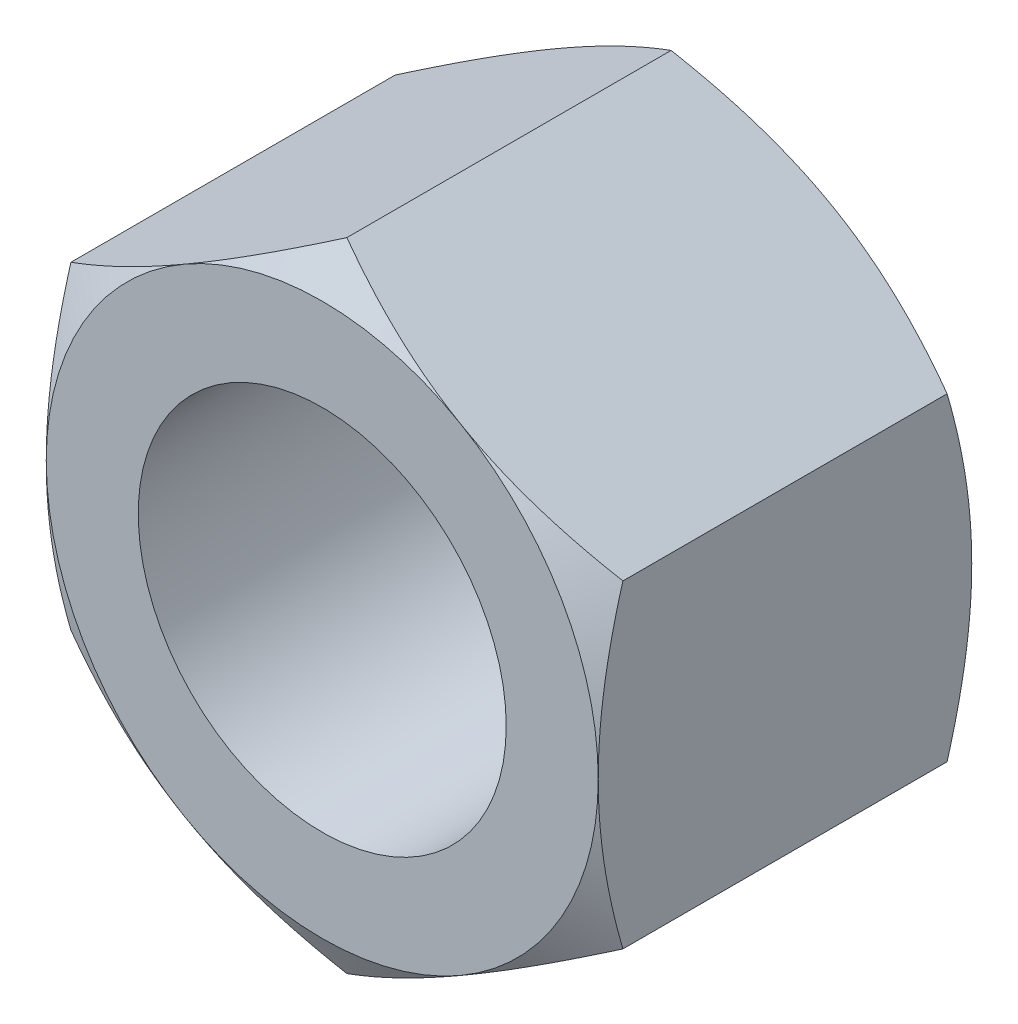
ISO-10303-21;
HEADER;
FILE_DESCRIPTION(('STEP AP214'),'2;1');
FILE_NAME('part.step','',(''),(''),'','','');
FILE_SCHEMA(('AUTOMOTIVE_DESIGN { 1 0 10303 214 1 1 1 1 }'));
ENDSEC;
DATA;
#1=APPLICATION_CONTEXT('core data for automotive mechanical design processes');
#2=APPLICATION_PROTOCOL_DEFINITION('international standard','automotive_design',2000,#1);
#3=PRODUCT_CONTEXT('',#1,'mechanical');
#4=PRODUCT('Part','Part','',(#3));
#5=PRODUCT_RELATED_PRODUCT_CATEGORY('part','',(#4));
#6=PRODUCT_DEFINITION_FORMATION('','',#4);
#7=PRODUCT_DEFINITION_CONTEXT('part definition',#1,'design');
#8=PRODUCT_DEFINITION('design','',#6,#7);
#9=PRODUCT_DEFINITION_SHAPE('','',#8);
#10=(LENGTH_UNIT() NAMED_UNIT(*) SI_UNIT(.MILLI.,.METRE.));
#11=(NAMED_UNIT(*) PLANE_ANGLE_UNIT() SI_UNIT($,.RADIAN.));
#12=(NAMED_UNIT(*) SI_UNIT($,.STERADIAN.) SOLID_ANGLE_UNIT());
#13=UNCERTAINTY_MEASURE_WITH_UNIT(LENGTH_MEASURE(1.E-05),#10,'distance_accuracy_value','');
#14=(GEOMETRIC_REPRESENTATION_CONTEXT(3) GLOBAL_UNCERTAINTY_ASSIGNED_CONTEXT((#13)) GLOBAL_UNIT_ASSIGNED_CONTEXT((#10,
#11,#12)) REPRESENTATION_CONTEXT('',''));
#15=CARTESIAN_POINT('',(0.,0.,0.));
#16=DIRECTION('',(0.,0.,1.));
#17=DIRECTION('',(1.,0.,0.));
#18=AXIS2_PLACEMENT_3D('',#15,#16,#17);
#19=CARTESIAN_POINT('',(-15.,25.9807621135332,0.));
#20=DIRECTION('',(0.,0.,-1.));
#21=DIRECTION('',(-1.,0.,0.));
#22=AXIS2_PLACEMENT_3D('',#19,#20,#21);
#23=PLANE('',#22);
#24=CARTESIAN_POINT('',(0.,0.,0.));
#25=DIRECTION('',(0.,0.,1.));
#26=DIRECTION('',(1.,0.,0.));
#27=AXIS2_PLACEMENT_3D('',#24,#25,#26);
#28=CIRCLE('',#27,10.);
#29=CARTESIAN_POINT('',(10.,0.,0.));
#30=VERTEX_POINT('',#29);
#31=EDGE_CURVE('E321',#30,#30,#28,.T.);
#32=ORIENTED_EDGE('',*,*,#31,.F.);
#33=EDGE_LOOP('',(#32));
#34=FACE_BOUND('',#33,.T.);
#35=CARTESIAN_POINT('',(0.,0.,0.));
#36=DIRECTION('',(0.,0.,-1.));
#37=DIRECTION('',(-1.,0.,0.));
#38=AXIS2_PLACEMENT_3D('',#35,#36,#37);
#39=CIRCLE('',#38,15.);
#40=CARTESIAN_POINT('',(-15.,0.,0.));
#41=VERTEX_POINT('',#40);
#42=CARTESIAN_POINT('',(-7.5,12.9903810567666,0.));
#43=VERTEX_POINT('',#42);
#44=EDGE_CURVE('E330',#41,#43,#39,.T.);
#45=ORIENTED_EDGE('',*,*,#44,.F.);
#46=CARTESIAN_POINT('',(0.,0.,0.));
#47=DIRECTION('',(0.,0.,-1.));
#48=DIRECTION('',(-1.,0.,0.));
#49=AXIS2_PLACEMENT_3D('',#46,#47,#48);
#50=CIRCLE('',#49,15.);
#51=CARTESIAN_POINT('',(-7.49999999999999,-12.9903810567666,0.));
#52=VERTEX_POINT('',#51);
#53=EDGE_CURVE('E151',#41,#52,#50,.F.);
#54=ORIENTED_EDGE('',*,*,#53,.T.);
#55=CARTESIAN_POINT('',(7.49999999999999,-12.9903810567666,0.));
#56=VERTEX_POINT('',#55);
#57=EDGE_CURVE('E253',#52,#56,#50,.F.);
#58=ORIENTED_EDGE('',*,*,#57,.T.);
#59=CARTESIAN_POINT('',(15.,0.,0.));
#60=VERTEX_POINT('',#59);
#61=EDGE_CURVE('E154',#56,#60,#50,.F.);
#62=ORIENTED_EDGE('',*,*,#61,.T.);
#63=CARTESIAN_POINT('',(7.49999999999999,12.9903810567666,0.));
#64=VERTEX_POINT('',#63);
#65=EDGE_CURVE('E129',#60,#64,#50,.F.);
#66=ORIENTED_EDGE('',*,*,#65,.T.);
#67=EDGE_CURVE('E142',#64,#43,#50,.F.);
#68=ORIENTED_EDGE('',*,*,#67,.T.);
#69=EDGE_LOOP('',(#45,#54,#58,#62,#66,#68));
#70=FACE_BOUND('',#69,.T.);
#71=ADVANCED_FACE('F34',(#34,#70),#23,.F.);
#72=CARTESIAN_POINT('',(0.,0.,0.));
#73=DIRECTION('',(0.,0.,-1.));
#74=DIRECTION('',(-1.,0.,0.));
#75=AXIS2_PLACEMENT_3D('',#72,#73,#74);
#76=CONICAL_SURFACE('',#75,15.,1.0471975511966);
#77=CARTESIAN_POINT('',(-15.,-23.4904131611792,-7.43114646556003));
#78=CARTESIAN_POINT('',(-15.,-23.1618336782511,-7.27126151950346));
#79=CARTESIAN_POINT('',(-15.,-22.8328746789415,-7.11215688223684));
#80=CARTESIAN_POINT('',(-15.,-22.174118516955,-6.79568453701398));
#81=CARTESIAN_POINT('',(-15.,-21.8443213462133,-6.63831684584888));
#82=CARTESIAN_POINT('',(-15.,-20.8534690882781,-6.16904360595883));
#83=CARTESIAN_POINT('',(-15.,-20.1910470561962,-5.86001365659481));
#84=CARTESIAN_POINT('',(-15.,-18.8583488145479,-5.24983359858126));
#85=CARTESIAN_POINT('',(-15.,-18.1880496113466,-4.9487335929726));
#86=CARTESIAN_POINT('',(-15.,-16.8421987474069,-4.35855270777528));
#87=CARTESIAN_POINT('',(-15.,-16.1666473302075,-4.06947127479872));
#88=CARTESIAN_POINT('',(-15.,-14.7867342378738,-3.49717646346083));
#89=CARTESIAN_POINT('',(-15.,-14.0821593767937,-3.2144744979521));
#90=CARTESIAN_POINT('',(-15.,-12.6648468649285,-2.66991879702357));
#91=CARTESIAN_POINT('',(-15.,-11.9521083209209,-2.40806736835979));
#92=CARTESIAN_POINT('',(-15.,-10.5186182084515,-1.91192323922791));
#93=CARTESIAN_POINT('',(-15.,-9.79788541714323,-1.67757671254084));
#94=CARTESIAN_POINT('',(-15.,-8.34601719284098,-1.24379590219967));
#95=CARTESIAN_POINT('',(-15.,-7.61488503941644,-1.04435086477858));
#96=CARTESIAN_POINT('',(-15.,-6.5122279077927,-0.778998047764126));
#97=CARTESIAN_POINT('',(-15.,-6.144704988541,-0.696364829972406));
#98=CARTESIAN_POINT('',(-15.,-5.40710648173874,-0.543338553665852));
#99=CARTESIAN_POINT('',(-15.,-5.03703094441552,-0.472945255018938));
#100=CARTESIAN_POINT('',(-15.,-4.29456640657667,-0.34562702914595));
#101=CARTESIAN_POINT('',(-15.,-3.92217745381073,-0.288701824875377));
#102=CARTESIAN_POINT('',(-15.,-3.17546275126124,-0.189446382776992));
#103=CARTESIAN_POINT('',(-15.,-2.80113708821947,-0.147115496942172));
#104=CARTESIAN_POINT('',(-15.,-2.05605882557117,-0.0784332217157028));
#105=CARTESIAN_POINT('',(-15.,-1.68532533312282,-0.0518758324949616));
#106=CARTESIAN_POINT('',(-15.,-0.94306746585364,-0.0144736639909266));
#107=CARTESIAN_POINT('',(-15.,-0.571543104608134,-0.00362861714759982));
#108=CARTESIAN_POINT('',(-15.,0.171634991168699,0.00208979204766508));
#109=CARTESIAN_POINT('',(-15.,0.543288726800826,-0.00303698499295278));
#110=CARTESIAN_POINT('',(-15.,1.28604284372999,-0.0291344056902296));
#111=CARTESIAN_POINT('',(-15.,1.65714319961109,-0.0501057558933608));
#112=CARTESIAN_POINT('',(-15.,2.54202943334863,-0.118553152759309));
#113=CARTESIAN_POINT('',(-15.,3.0552761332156,-0.173158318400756));
#114=CARTESIAN_POINT('',(-15.,4.07808576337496,-0.30974949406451));
#115=CARTESIAN_POINT('',(-15.,4.58764821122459,-0.391739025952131));
#116=CARTESIAN_POINT('',(-15.,6.11014165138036,-0.674446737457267));
#117=CARTESIAN_POINT('',(-15.,7.1163563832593,-0.911858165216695));
#118=CARTESIAN_POINT('',(-15.,8.62155277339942,-1.32523606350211));
#119=CARTESIAN_POINT('',(-15.,9.1282913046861,-1.47459619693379));
#120=CARTESIAN_POINT('',(-15.,10.1368495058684,-1.78923970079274));
#121=CARTESIAN_POINT('',(-15.,10.638669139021,-1.95452319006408));
#122=CARTESIAN_POINT('',(-15.,11.6375428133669,-2.29832899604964));
#123=CARTESIAN_POINT('',(-15.,12.1345982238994,-2.47684737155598));
#124=CARTESIAN_POINT('',(-15.,13.1245637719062,-2.84497412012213));
#125=CARTESIAN_POINT('',(-15.,13.6174739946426,-3.03458226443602));
#126=CARTESIAN_POINT('',(-15.,14.5118715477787,-3.38837174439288));
#127=CARTESIAN_POINT('',(-15.,14.9139586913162,-3.5510434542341));
#128=CARTESIAN_POINT('',(-15.,15.7158954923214,-3.88181839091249));
#129=CARTESIAN_POINT('',(-15.,16.1157451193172,-4.04992169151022));
#130=CARTESIAN_POINT('',(-15.,17.3123403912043,-4.56130246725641));
#131=CARTESIAN_POINT('',(-15.,18.1060757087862,-4.91162814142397));
#132=CARTESIAN_POINT('',(-15.,19.6873266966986,-5.62668204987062));
#133=CARTESIAN_POINT('',(-15.,20.4748400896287,-5.99141528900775));
#134=CARTESIAN_POINT('',(-15.,22.0445996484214,-6.73194875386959));
#135=CARTESIAN_POINT('',(-15.,22.8268460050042,-7.10774857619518));
#136=CARTESIAN_POINT('',(-15.,24.3882576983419,-7.86862667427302));
#137=CARTESIAN_POINT('',(-15.,25.1674166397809,-8.25371804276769));
#138=CARTESIAN_POINT('',(-15.,26.722253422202,-9.03086916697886));
#139=CARTESIAN_POINT('',(-15.,27.4979312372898,-9.42292897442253));
#140=CARTESIAN_POINT('',(-15.,29.046259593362,-10.2125977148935));
#141=CARTESIAN_POINT('',(-15.,29.8189107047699,-10.6102055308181));
#142=CARTESIAN_POINT('',(-15.,31.3618196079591,-11.410027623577));
#143=CARTESIAN_POINT('',(-15.,32.1320774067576,-11.812241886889));
#144=CARTESIAN_POINT('',(-15.,34.2831316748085,-12.9422397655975));
#145=CARTESIAN_POINT('',(-15.,35.6617097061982,-13.6742456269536));
#146=CARTESIAN_POINT('',(-15.,38.4141744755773,-15.1471889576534));
#147=CARTESIAN_POINT('',(-15.,39.7880609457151,-15.8881269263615));
#148=CARTESIAN_POINT('',(-15.,42.5278419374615,-17.374326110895));
#149=CARTESIAN_POINT('',(-15.,43.8937479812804,-18.1195660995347));
#150=CARTESIAN_POINT('',(-15.,45.9404520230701,-19.2412354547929));
#151=CARTESIAN_POINT('',(-15.,46.6223027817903,-19.6157464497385));
#152=CARTESIAN_POINT('',(-15.,47.9853767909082,-20.3659066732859));
#153=CARTESIAN_POINT('',(-15.,48.6666000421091,-20.7415559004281));
#154=CARTESIAN_POINT('',(-15.,49.3475475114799,-21.1177045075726));
#155=B_SPLINE_CURVE_WITH_KNOTS('',3,(#77,#78,#79,#80,#81,#82,#83,#84,#85,#86,#87,#88,#89,#90,
#91,#92,#93,#94,#95,#96,#97,#98,#99,#100,#101,#102,#103,#104,#105,#106,#107,#108,#109,#110,#111,
#112,#113,#114,#115,#116,#117,#118,#119,#120,#121,#122,#123,#124,#125,#126,#127,#128,#129,#130,
#131,#132,#133,#134,#135,#136,#137,#138,#139,#140,#141,#142,#143,#144,#145,#146,#147,#148,#149,
#150,#151,#152,#153,#154),.UNSPECIFIED.,.F.,.F.,(4,2,2,2,2,2,2,2,2,2,2,2,2,2,2,2,2,2,2,2,2,2,2,
2,2,2,2,2,2,2,2,2,2,2,2,2,2,2,4),(0.,1.09624123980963,2.19249306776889,4.3853098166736,
6.58968145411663,8.79395147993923,11.0712233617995,13.3487468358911,15.6217362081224,
17.8940239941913,19.0239470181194,20.1538478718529,21.2837254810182,22.4135529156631,
23.5282805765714,24.6429892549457,25.7577076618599,26.8724757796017,28.4200363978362,
29.9677961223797,33.0648815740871,34.6496189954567,36.2343682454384,37.8186474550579,
39.4028939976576,40.7040914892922,42.0053066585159,44.6079201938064,47.2114459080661,
49.8148768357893,52.4222194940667,55.0295815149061,57.6364259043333,60.243262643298,
64.9258167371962,69.6086338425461,74.2765665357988,76.6103631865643,78.9441568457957),.UNSPECIFIED.);
#156=CARTESIAN_POINT('',(-15.,8.66025403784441,-1.33974596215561));
#157=VERTEX_POINT('',#156);
#158=EDGE_CURVE('E159',#157,#41,#155,.F.);
#159=ORIENTED_EDGE('',*,*,#158,.T.);
#160=ORIENTED_EDGE('',*,*,#44,.T.);
#161=CARTESIAN_POINT('',(0.0002,17.3206235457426,-1.33981262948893));
#162=CARTESIAN_POINT('',(-0.329494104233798,17.130274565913,-1.22992178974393));
#163=CARTESIAN_POINT('',(-0.660474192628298,16.939183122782,-1.12501758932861));
#164=CARTESIAN_POINT('',(-1.32508844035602,16.5554679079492,-0.926568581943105));
#165=CARTESIAN_POINT('',(-1.6587234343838,16.3628436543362,-0.833027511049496));
#166=CARTESIAN_POINT('',(-2.32929228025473,15.9756905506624,-0.658562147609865));
#167=CARTESIAN_POINT('',(-2.66623200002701,15.7811583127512,-0.577667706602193));
#168=CARTESIAN_POINT('',(-3.34245276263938,15.3907420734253,-0.430232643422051));
#169=CARTESIAN_POINT('',(-3.68173367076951,15.1948581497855,-0.363691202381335));
#170=CARTESIAN_POINT('',(-4.35394314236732,14.8067578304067,-0.247792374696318));
#171=CARTESIAN_POINT('',(-4.68682180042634,14.6145702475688,-0.198051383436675));
#172=CARTESIAN_POINT('',(-5.3541044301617,14.2293144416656,-0.114646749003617));
#173=CARTESIAN_POINT('',(-5.6885084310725,14.0362462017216,-0.0809834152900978));
#174=CARTESIAN_POINT('',(-6.35787818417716,13.6497853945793,-0.0305840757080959));
#175=CARTESIAN_POINT('',(-6.69284279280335,13.4563934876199,-0.0138279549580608));
#176=CARTESIAN_POINT('',(-7.36308121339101,13.0694311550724,0.00239660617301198));
#177=CARTESIAN_POINT('',(-7.69835501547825,12.8758607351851,0.00186558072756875));
#178=CARTESIAN_POINT('',(-8.32514688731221,12.5139822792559,-0.0152766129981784));
#179=CARTESIAN_POINT('',(-8.61670962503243,12.3456484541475,-0.029796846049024));
#180=CARTESIAN_POINT('',(-9.19916443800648,12.0093680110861,-0.0716371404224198));
#181=CARTESIAN_POINT('',(-9.49005646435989,11.8414214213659,-0.0989581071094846));
#182=CARTESIAN_POINT('',(-10.0710118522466,11.5060066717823,-0.165923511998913));
#183=CARTESIAN_POINT('',(-10.3610743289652,11.338539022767,-0.20557812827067));
#184=CARTESIAN_POINT('',(-10.939839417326,11.0043888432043,-0.296515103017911));
#185=CARTESIAN_POINT('',(-11.2285419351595,10.8377063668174,-0.347798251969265));
#186=CARTESIAN_POINT('',(-12.1049144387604,10.3317324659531,-0.520386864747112));
#187=CARTESIAN_POINT('',(-12.6900465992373,9.99390625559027,-0.658901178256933));
#188=CARTESIAN_POINT('',(-13.8515859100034,9.32329122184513,-0.973271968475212));
#189=CARTESIAN_POINT('',(-14.4280079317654,8.99049381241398,-1.14905461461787));
#190=CARTESIAN_POINT('',(-15.0002,8.66013856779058,-1.33981262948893));
#191=B_SPLINE_CURVE_WITH_KNOTS('',3,(#161,#162,#163,#164,#165,#166,#167,#168,#169,#170,#171,
#172,#173,#174,#175,#176,#177,#178,#179,#180,#181,#182,#183,#184,#185,#186,#187,#188,#189,#190),
.UNSPECIFIED.,.F.,.F.,(4,2,2,2,2,2,2,2,2,2,2,2,2,2,4),(0.,1.18875411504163,2.37789802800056,
3.56980778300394,4.76164951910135,5.92407379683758,7.08652044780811,8.24758247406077,
9.40860862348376,10.4193068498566,11.4300765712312,12.4416826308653,13.4533574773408,
15.5211962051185,17.584976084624),.UNSPECIFIED.);
#192=EDGE_CURVE('E191',#43,#157,#191,.T.);
#193=ORIENTED_EDGE('',*,*,#192,.T.);
#194=EDGE_LOOP('',(#159,#160,#193));
#195=FACE_BOUND('',#194,.T.);
#196=ADVANCED_FACE('F178',(#195),#76,.T.);
#197=CARTESIAN_POINT('',(15.0002,8.66013856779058,-1.33981262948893));
#198=CARTESIAN_POINT('',(14.6705058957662,8.85048754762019,-1.22992178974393));
#199=CARTESIAN_POINT('',(14.3395258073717,9.04157899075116,-1.12501758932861));
#200=CARTESIAN_POINT('',(13.674911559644,9.42529420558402,-0.926568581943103));
#201=CARTESIAN_POINT('',(13.3412765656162,9.61791845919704,-0.833027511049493));
#202=CARTESIAN_POINT('',(12.6707077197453,10.0050715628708,-0.658562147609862));
#203=CARTESIAN_POINT('',(12.333767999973,10.199603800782,-0.57766770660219));
#204=CARTESIAN_POINT('',(11.6575472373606,10.5900200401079,-0.430232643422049));
#205=CARTESIAN_POINT('',(11.3182663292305,10.7859039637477,-0.363691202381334));
#206=CARTESIAN_POINT('',(10.6460568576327,11.1740042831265,-0.247792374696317));
#207=CARTESIAN_POINT('',(10.3131781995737,11.3661918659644,-0.198051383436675));
#208=CARTESIAN_POINT('',(9.6458955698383,11.7514476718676,-0.114646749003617));
#209=CARTESIAN_POINT('',(9.3114915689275,11.9445159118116,-0.0809834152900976));
#210=CARTESIAN_POINT('',(8.64212181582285,12.3309767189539,-0.0305840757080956));
#211=CARTESIAN_POINT('',(8.30715720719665,12.5243686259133,-0.0138279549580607));
#212=CARTESIAN_POINT('',(7.63691878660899,12.9113309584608,0.00239660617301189));
#213=CARTESIAN_POINT('',(7.30164498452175,13.1049013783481,0.00186558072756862));
#214=CARTESIAN_POINT('',(6.67485311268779,13.4667798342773,-0.0152766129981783));
#215=CARTESIAN_POINT('',(6.38329037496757,13.6351136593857,-0.0297968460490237));
#216=CARTESIAN_POINT('',(5.80083556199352,13.9713941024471,-0.0716371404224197));
#217=CARTESIAN_POINT('',(5.50994353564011,14.1393406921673,-0.0989581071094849));
#218=CARTESIAN_POINT('',(4.92898814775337,14.4747554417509,-0.165923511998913));
#219=CARTESIAN_POINT('',(4.63892567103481,14.6422230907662,-0.20557812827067));
#220=CARTESIAN_POINT('',(4.06016058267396,14.9763732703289,-0.296515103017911));
#221=CARTESIAN_POINT('',(3.77145806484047,15.1430557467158,-0.347798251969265));
#222=CARTESIAN_POINT('',(2.89508556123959,15.6490296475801,-0.520386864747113));
#223=CARTESIAN_POINT('',(2.30995340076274,15.9868558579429,-0.658901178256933));
#224=CARTESIAN_POINT('',(1.14841408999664,16.6574708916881,-0.973271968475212));
#225=CARTESIAN_POINT('',(0.571992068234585,16.9902683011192,-1.14905461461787));
#226=CARTESIAN_POINT('',(-0.000199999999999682,17.3206235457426,-1.33981262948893));
#227=B_SPLINE_CURVE_WITH_KNOTS('',3,(#197,#198,#199,#200,#201,#202,#203,#204,#205,#206,#207,
#208,#209,#210,#211,#212,#213,#214,#215,#216,#217,#218,#219,#220,#221,#222,#223,#224,#225,#226),
.UNSPECIFIED.,.F.,.F.,(4,2,2,2,2,2,2,2,2,2,2,2,2,2,4),(0.,1.18875411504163,2.37789802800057,
3.56980778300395,4.76164951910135,5.92407379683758,7.08652044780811,8.24758247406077,
9.40860862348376,10.4193068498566,11.4300765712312,12.4416826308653,13.4533574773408,
15.5211962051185,17.5849760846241),.UNSPECIFIED.);
#228=CARTESIAN_POINT('',(0.,17.3205080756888,-1.3397459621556));
#229=VERTEX_POINT('',#228);
#230=EDGE_CURVE('E138',#64,#229,#227,.T.);
#231=ORIENTED_EDGE('',*,*,#230,.T.);
#232=EDGE_CURVE('E145',#229,#43,#191,.T.);
#233=ORIENTED_EDGE('',*,*,#232,.T.);
#234=ORIENTED_EDGE('',*,*,#67,.F.);
#235=EDGE_LOOP('',(#231,#233,#234));
#236=FACE_BOUND('',#235,.T.);
#237=ADVANCED_FACE('F143',(#236),#76,.T.);
#238=CARTESIAN_POINT('',(15.,-23.4904131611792,-7.43114646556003));
#239=CARTESIAN_POINT('',(15.,-23.1618336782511,-7.27126151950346));
#240=CARTESIAN_POINT('',(15.,-22.8328746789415,-7.11215688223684));
#241=CARTESIAN_POINT('',(15.,-22.174118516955,-6.79568453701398));
#242=CARTESIAN_POINT('',(15.,-21.8443213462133,-6.63831684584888));
#243=CARTESIAN_POINT('',(15.,-20.8534690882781,-6.16904360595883));
#244=CARTESIAN_POINT('',(15.,-20.1910470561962,-5.86001365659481));
#245=CARTESIAN_POINT('',(15.,-18.8583488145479,-5.24983359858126));
#246=CARTESIAN_POINT('',(15.,-18.1880496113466,-4.9487335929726));
#247=CARTESIAN_POINT('',(15.,-16.8421987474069,-4.35855270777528));
#248=CARTESIAN_POINT('',(15.,-16.1666473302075,-4.06947127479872));
#249=CARTESIAN_POINT('',(15.,-14.7867342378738,-3.49717646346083));
#250=CARTESIAN_POINT('',(15.,-14.0821593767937,-3.2144744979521));
#251=CARTESIAN_POINT('',(15.,-12.6648468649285,-2.66991879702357));
#252=CARTESIAN_POINT('',(15.,-11.9521083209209,-2.40806736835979));
#253=CARTESIAN_POINT('',(15.,-10.5186182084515,-1.91192323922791));
#254=CARTESIAN_POINT('',(15.,-9.79788541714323,-1.67757671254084));
#255=CARTESIAN_POINT('',(15.,-8.34601719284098,-1.24379590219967));
#256=CARTESIAN_POINT('',(15.,-7.61488503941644,-1.04435086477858));
#257=CARTESIAN_POINT('',(15.,-6.5122279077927,-0.778998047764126));
#258=CARTESIAN_POINT('',(15.,-6.144704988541,-0.696364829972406));
#259=CARTESIAN_POINT('',(15.,-5.40710648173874,-0.543338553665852));
#260=CARTESIAN_POINT('',(15.,-5.03703094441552,-0.472945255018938));
#261=CARTESIAN_POINT('',(15.,-4.29456640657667,-0.34562702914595));
#262=CARTESIAN_POINT('',(15.,-3.92217745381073,-0.288701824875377));
#263=CARTESIAN_POINT('',(15.,-3.17546275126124,-0.189446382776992));
#264=CARTESIAN_POINT('',(15.,-2.80113708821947,-0.147115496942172));
#265=CARTESIAN_POINT('',(15.,-2.05605882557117,-0.0784332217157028));
#266=CARTESIAN_POINT('',(15.,-1.68532533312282,-0.0518758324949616));
#267=CARTESIAN_POINT('',(15.,-0.94306746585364,-0.0144736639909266));
#268=CARTESIAN_POINT('',(15.,-0.571543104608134,-0.00362861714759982));
#269=CARTESIAN_POINT('',(15.,0.171634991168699,0.00208979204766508));
#270=CARTESIAN_POINT('',(15.,0.543288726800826,-0.00303698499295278));
#271=CARTESIAN_POINT('',(15.,1.28604284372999,-0.0291344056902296));
#272=CARTESIAN_POINT('',(15.,1.65714319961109,-0.0501057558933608));
#273=CARTESIAN_POINT('',(15.,2.54202943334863,-0.118553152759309));
#274=CARTESIAN_POINT('',(15.,3.0552761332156,-0.173158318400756));
#275=CARTESIAN_POINT('',(15.,4.07808576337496,-0.30974949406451));
#276=CARTESIAN_POINT('',(15.,4.58764821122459,-0.391739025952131));
#277=CARTESIAN_POINT('',(15.,6.11014165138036,-0.674446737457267));
#278=CARTESIAN_POINT('',(15.,7.1163563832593,-0.911858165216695));
#279=CARTESIAN_POINT('',(15.,8.62155277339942,-1.32523606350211));
#280=CARTESIAN_POINT('',(15.,9.1282913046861,-1.47459619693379));
#281=CARTESIAN_POINT('',(15.,10.1368495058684,-1.78923970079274));
#282=CARTESIAN_POINT('',(15.,10.638669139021,-1.95452319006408));
#283=CARTESIAN_POINT('',(15.,11.6375428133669,-2.29832899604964));
#284=CARTESIAN_POINT('',(15.,12.1345982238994,-2.47684737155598));
#285=CARTESIAN_POINT('',(15.,13.1245637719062,-2.84497412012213));
#286=CARTESIAN_POINT('',(15.,13.6174739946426,-3.03458226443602));
#287=CARTESIAN_POINT('',(15.,14.5118715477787,-3.38837174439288));
#288=CARTESIAN_POINT('',(15.,14.9139586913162,-3.5510434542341));
#289=CARTESIAN_POINT('',(15.,15.7158954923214,-3.88181839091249));
#290=CARTESIAN_POINT('',(15.,16.1157451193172,-4.04992169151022));
#291=CARTESIAN_POINT('',(15.,17.3123403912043,-4.56130246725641));
#292=CARTESIAN_POINT('',(15.,18.1060757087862,-4.91162814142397));
#293=CARTESIAN_POINT('',(15.,19.6873266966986,-5.62668204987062));
#294=CARTESIAN_POINT('',(15.,20.4748400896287,-5.99141528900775));
#295=CARTESIAN_POINT('',(15.,22.0445996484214,-6.73194875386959));
#296=CARTESIAN_POINT('',(15.,22.8268460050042,-7.10774857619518));
#297=CARTESIAN_POINT('',(15.,24.3882576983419,-7.86862667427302));
#298=CARTESIAN_POINT('',(15.,25.1674166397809,-8.25371804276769));
#299=CARTESIAN_POINT('',(15.,26.722253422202,-9.03086916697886));
#300=CARTESIAN_POINT('',(15.,27.4979312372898,-9.42292897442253));
#301=CARTESIAN_POINT('',(15.,29.046259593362,-10.2125977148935));
#302=CARTESIAN_POINT('',(15.,29.8189107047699,-10.6102055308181));
#303=CARTESIAN_POINT('',(15.,31.3618196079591,-11.410027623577));
#304=CARTESIAN_POINT('',(15.,32.1320774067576,-11.812241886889));
#305=CARTESIAN_POINT('',(15.,34.2831316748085,-12.9422397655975));
#306=CARTESIAN_POINT('',(15.,35.6617097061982,-13.6742456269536));
#307=CARTESIAN_POINT('',(15.,38.4141744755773,-15.1471889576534));
#308=CARTESIAN_POINT('',(15.,39.7880609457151,-15.8881269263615));
#309=CARTESIAN_POINT('',(15.,42.5278419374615,-17.374326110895));
#310=CARTESIAN_POINT('',(15.,43.8937479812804,-18.1195660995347));
#311=CARTESIAN_POINT('',(15.,45.9404520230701,-19.2412354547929));
#312=CARTESIAN_POINT('',(15.,46.6223027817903,-19.6157464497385));
#313=CARTESIAN_POINT('',(15.,47.9853767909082,-20.3659066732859));
#314=CARTESIAN_POINT('',(15.,48.6666000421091,-20.7415559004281));
#315=CARTESIAN_POINT('',(15.,49.3475475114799,-21.1177045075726));
#316=B_SPLINE_CURVE_WITH_KNOTS('',3,(#238,#239,#240,#241,#242,#243,#244,#245,#246,#247,#248,
#249,#250,#251,#252,#253,#254,#255,#256,#257,#258,#259,#260,#261,#262,#263,#264,#265,#266,#267,
#268,#269,#270,#271,#272,#273,#274,#275,#276,#277,#278,#279,#280,#281,#282,#283,#284,#285,#286,
#287,#288,#289,#290,#291,#292,#293,#294,#295,#296,#297,#298,#299,#300,#301,#302,#303,#304,#305,
#306,#307,#308,#309,#310,#311,#312,#313,#314,#315),.UNSPECIFIED.,.F.,.F.,(4,2,2,2,2,2,2,2,2,2,2,
2,2,2,2,2,2,2,2,2,2,2,2,2,2,2,2,2,2,2,2,2,2,2,2,2,2,2,4),(0.,1.09624123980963,2.19249306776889,
4.3853098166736,6.58968145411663,8.79395147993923,11.0712233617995,13.3487468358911,
15.6217362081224,17.8940239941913,19.0239470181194,20.1538478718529,21.2837254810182,
22.4135529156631,23.5282805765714,24.6429892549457,25.7577076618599,26.8724757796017,
28.4200363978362,29.9677961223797,33.0648815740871,34.6496189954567,36.2343682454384,
37.8186474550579,39.4028939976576,40.7040914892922,42.0053066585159,44.6079201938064,
47.2114459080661,49.8148768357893,52.4222194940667,55.0295815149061,57.6364259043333,
60.243262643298,64.9258167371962,69.6086338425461,74.2765665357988,76.6103631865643,
78.9441568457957),.UNSPECIFIED.);
#317=CARTESIAN_POINT('',(15.,8.66025403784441,-1.33974596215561));
#318=VERTEX_POINT('',#317);
#319=EDGE_CURVE('E132',#60,#318,#316,.T.);
#320=ORIENTED_EDGE('',*,*,#319,.T.);
#321=EDGE_CURVE('E125',#318,#64,#227,.T.);
#322=ORIENTED_EDGE('',*,*,#321,.T.);
#323=ORIENTED_EDGE('',*,*,#65,.F.);
#324=EDGE_LOOP('',(#320,#322,#323));
#325=FACE_BOUND('',#324,.T.);
#326=ADVANCED_FACE('F127',(#325),#76,.T.);
#327=CARTESIAN_POINT('',(-0.0002,-17.3206235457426,-1.33981262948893));
#328=CARTESIAN_POINT('',(0.329494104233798,-17.130274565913,-1.22992178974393));
#329=CARTESIAN_POINT('',(0.660474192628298,-16.939183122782,-1.12501758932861));
#330=CARTESIAN_POINT('',(1.32508844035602,-16.5554679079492,-0.926568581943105));
#331=CARTESIAN_POINT('',(1.6587234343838,-16.3628436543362,-0.833027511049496));
#332=CARTESIAN_POINT('',(2.32929228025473,-15.9756905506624,-0.658562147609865));
#333=CARTESIAN_POINT('',(2.66623200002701,-15.7811583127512,-0.577667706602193));
#334=CARTESIAN_POINT('',(3.34245276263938,-15.3907420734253,-0.430232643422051));
#335=CARTESIAN_POINT('',(3.68173367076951,-15.1948581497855,-0.363691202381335));
#336=CARTESIAN_POINT('',(4.35394314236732,-14.8067578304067,-0.247792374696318));
#337=CARTESIAN_POINT('',(4.68682180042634,-14.6145702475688,-0.198051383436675));
#338=CARTESIAN_POINT('',(5.3541044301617,-14.2293144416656,-0.114646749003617));
#339=CARTESIAN_POINT('',(5.6885084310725,-14.0362462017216,-0.0809834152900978));
#340=CARTESIAN_POINT('',(6.35787818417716,-13.6497853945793,-0.0305840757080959));
#341=CARTESIAN_POINT('',(6.69284279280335,-13.4563934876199,-0.0138279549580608));
#342=CARTESIAN_POINT('',(7.36308121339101,-13.0694311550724,0.00239660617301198));
#343=CARTESIAN_POINT('',(7.69835501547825,-12.8758607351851,0.00186558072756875));
#344=CARTESIAN_POINT('',(8.32514688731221,-12.5139822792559,-0.0152766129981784));
#345=CARTESIAN_POINT('',(8.61670962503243,-12.3456484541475,-0.029796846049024));
#346=CARTESIAN_POINT('',(9.19916443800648,-12.0093680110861,-0.0716371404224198));
#347=CARTESIAN_POINT('',(9.49005646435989,-11.8414214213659,-0.0989581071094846));
#348=CARTESIAN_POINT('',(10.0710118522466,-11.5060066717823,-0.165923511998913));
#349=CARTESIAN_POINT('',(10.3610743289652,-11.338539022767,-0.20557812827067));
#350=CARTESIAN_POINT('',(10.939839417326,-11.0043888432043,-0.296515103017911));
#351=CARTESIAN_POINT('',(11.2285419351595,-10.8377063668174,-0.347798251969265));
#352=CARTESIAN_POINT('',(12.1049144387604,-10.3317324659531,-0.520386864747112));
#353=CARTESIAN_POINT('',(12.6900465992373,-9.99390625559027,-0.658901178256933));
#354=CARTESIAN_POINT('',(13.8515859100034,-9.32329122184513,-0.973271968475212));
#355=CARTESIAN_POINT('',(14.4280079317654,-8.99049381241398,-1.14905461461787));
#356=CARTESIAN_POINT('',(15.0002,-8.66013856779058,-1.33981262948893));
#357=B_SPLINE_CURVE_WITH_KNOTS('',3,(#327,#328,#329,#330,#331,#332,#333,#334,#335,#336,#337,
#338,#339,#340,#341,#342,#343,#344,#345,#346,#347,#348,#349,#350,#351,#352,#353,#354,#355,#356),
.UNSPECIFIED.,.F.,.F.,(4,2,2,2,2,2,2,2,2,2,2,2,2,2,4),(0.,1.18875411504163,2.37789802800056,
3.56980778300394,4.76164951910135,5.92407379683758,7.08652044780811,8.24758247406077,
9.40860862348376,10.4193068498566,11.4300765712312,12.4416826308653,13.4533574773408,
15.5211962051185,17.584976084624),.UNSPECIFIED.);
#358=CARTESIAN_POINT('',(15.,-8.66025403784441,-1.3397459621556));
#359=VERTEX_POINT('',#358);
#360=EDGE_CURVE('E205',#56,#359,#357,.T.);
#361=ORIENTED_EDGE('',*,*,#360,.T.);
#362=EDGE_CURVE('E204',#359,#60,#316,.T.);
#363=ORIENTED_EDGE('',*,*,#362,.T.);
#364=ORIENTED_EDGE('',*,*,#61,.F.);
#365=EDGE_LOOP('',(#361,#363,#364));
#366=FACE_BOUND('',#365,.T.);
#367=ADVANCED_FACE('F431',(#366),#76,.T.);
#368=CARTESIAN_POINT('',(0.,-17.3205080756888,-1.3397459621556));
#369=VERTEX_POINT('',#368);
#370=EDGE_CURVE('E263',#369,#56,#357,.T.);
#371=ORIENTED_EDGE('',*,*,#370,.T.);
#372=ORIENTED_EDGE('',*,*,#57,.F.);
#373=CARTESIAN_POINT('',(-15.0002,-8.66013856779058,-1.33981262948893));
#374=CARTESIAN_POINT('',(-14.6705058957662,-8.85048754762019,-1.22992178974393));
#375=CARTESIAN_POINT('',(-14.3395258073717,-9.04157899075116,-1.12501758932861));
#376=CARTESIAN_POINT('',(-13.674911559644,-9.42529420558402,-0.926568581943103));
#377=CARTESIAN_POINT('',(-13.3412765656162,-9.61791845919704,-0.833027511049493));
#378=CARTESIAN_POINT('',(-12.6707077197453,-10.0050715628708,-0.658562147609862));
#379=CARTESIAN_POINT('',(-12.333767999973,-10.199603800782,-0.57766770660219));
#380=CARTESIAN_POINT('',(-11.6575472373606,-10.5900200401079,-0.430232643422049));
#381=CARTESIAN_POINT('',(-11.3182663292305,-10.7859039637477,-0.363691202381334));
#382=CARTESIAN_POINT('',(-10.6460568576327,-11.1740042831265,-0.247792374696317));
#383=CARTESIAN_POINT('',(-10.3131781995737,-11.3661918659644,-0.198051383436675));
#384=CARTESIAN_POINT('',(-9.6458955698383,-11.7514476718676,-0.114646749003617));
#385=CARTESIAN_POINT('',(-9.3114915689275,-11.9445159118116,-0.0809834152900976));
#386=CARTESIAN_POINT('',(-8.64212181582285,-12.3309767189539,-0.0305840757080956));
#387=CARTESIAN_POINT('',(-8.30715720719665,-12.5243686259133,-0.0138279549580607));
#388=CARTESIAN_POINT('',(-7.63691878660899,-12.9113309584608,0.00239660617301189));
#389=CARTESIAN_POINT('',(-7.30164498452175,-13.1049013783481,0.00186558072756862));
#390=CARTESIAN_POINT('',(-6.67485311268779,-13.4667798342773,-0.0152766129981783));
#391=CARTESIAN_POINT('',(-6.38329037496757,-13.6351136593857,-0.0297968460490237));
#392=CARTESIAN_POINT('',(-5.80083556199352,-13.9713941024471,-0.0716371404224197));
#393=CARTESIAN_POINT('',(-5.50994353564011,-14.1393406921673,-0.0989581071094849));
#394=CARTESIAN_POINT('',(-4.92898814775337,-14.4747554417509,-0.165923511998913));
#395=CARTESIAN_POINT('',(-4.63892567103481,-14.6422230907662,-0.20557812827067));
#396=CARTESIAN_POINT('',(-4.06016058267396,-14.9763732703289,-0.296515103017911));
#397=CARTESIAN_POINT('',(-3.77145806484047,-15.1430557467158,-0.347798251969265));
#398=CARTESIAN_POINT('',(-2.89508556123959,-15.6490296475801,-0.520386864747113));
#399=CARTESIAN_POINT('',(-2.30995340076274,-15.9868558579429,-0.658901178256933));
#400=CARTESIAN_POINT('',(-1.14841408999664,-16.6574708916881,-0.973271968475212));
#401=CARTESIAN_POINT('',(-0.571992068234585,-16.9902683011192,-1.14905461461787));
#402=CARTESIAN_POINT('',(0.000199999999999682,-17.3206235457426,-1.33981262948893));
#403=B_SPLINE_CURVE_WITH_KNOTS('',3,(#373,#374,#375,#376,#377,#378,#379,#380,#381,#382,#383,
#384,#385,#386,#387,#388,#389,#390,#391,#392,#393,#394,#395,#396,#397,#398,#399,#400,#401,#402),
.UNSPECIFIED.,.F.,.F.,(4,2,2,2,2,2,2,2,2,2,2,2,2,2,4),(0.,1.18875411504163,2.37789802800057,
3.56980778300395,4.76164951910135,5.92407379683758,7.08652044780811,8.24758247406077,
9.40860862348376,10.4193068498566,11.4300765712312,12.4416826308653,13.4533574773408,
15.5211962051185,17.5849760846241),.UNSPECIFIED.);
#404=EDGE_CURVE('E267',#52,#369,#403,.T.);
#405=ORIENTED_EDGE('',*,*,#404,.T.);
#406=EDGE_LOOP('',(#371,#372,#405));
#407=FACE_BOUND('',#406,.T.);
#408=ADVANCED_FACE('F184',(#407),#76,.T.);
#409=CARTESIAN_POINT('',(-15.,-8.66025403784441,-1.3397459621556));
#410=VERTEX_POINT('',#409);
#411=EDGE_CURVE('E172',#410,#52,#403,.T.);
#412=ORIENTED_EDGE('',*,*,#411,.T.);
#413=ORIENTED_EDGE('',*,*,#53,.F.);
#414=EDGE_CURVE('E137',#41,#410,#155,.F.);
#415=ORIENTED_EDGE('',*,*,#414,.T.);
#416=EDGE_LOOP('',(#412,#413,#415));
#417=FACE_BOUND('',#416,.T.);
#418=ADVANCED_FACE('F272',(#417),#76,.T.);
#419=CARTESIAN_POINT('',(15.,8.66025403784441,-20.3));
#420=DIRECTION('',(0.5,0.866025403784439,0.));
#421=DIRECTION('',(-0.866025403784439,0.5,0.));
#422=AXIS2_PLACEMENT_3D('',#419,#420,#421);
#423=PLANE('',#422);
#424=CARTESIAN_POINT('',(-0.000200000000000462,17.3206235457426,-18.9601873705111));
#425=CARTESIAN_POINT('',(0.329494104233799,17.130274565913,-19.0700782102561));
#426=CARTESIAN_POINT('',(0.660474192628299,16.939183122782,-19.1749824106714));
#427=CARTESIAN_POINT('',(1.32508844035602,16.5554679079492,-19.3734314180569));
#428=CARTESIAN_POINT('',(1.6587234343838,16.3628436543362,-19.4669724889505));
#429=CARTESIAN_POINT('',(2.32929228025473,15.9756905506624,-19.6414378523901));
#430=CARTESIAN_POINT('',(2.66623200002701,15.7811583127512,-19.7223322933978));
#431=CARTESIAN_POINT('',(3.34245276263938,15.3907420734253,-19.869767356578));
#432=CARTESIAN_POINT('',(3.68173367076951,15.1948581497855,-19.9363087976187));
#433=CARTESIAN_POINT('',(4.35394314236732,14.8067578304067,-20.0522076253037));
#434=CARTESIAN_POINT('',(4.68682180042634,14.6145702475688,-20.1019486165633));
#435=CARTESIAN_POINT('',(5.3541044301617,14.2293144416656,-20.1853532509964));
#436=CARTESIAN_POINT('',(5.6885084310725,14.0362462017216,-20.2190165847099));
#437=CARTESIAN_POINT('',(6.35787818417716,13.6497853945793,-20.2694159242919));
#438=CARTESIAN_POINT('',(6.69284279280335,13.4563934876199,-20.2861720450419));
#439=CARTESIAN_POINT('',(7.36308121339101,13.0694311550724,-20.302396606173));
#440=CARTESIAN_POINT('',(7.69835501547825,12.8758607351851,-20.3018655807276));
#441=CARTESIAN_POINT('',(8.32514688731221,12.5139822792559,-20.2847233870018));
#442=CARTESIAN_POINT('',(8.61670962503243,12.3456484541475,-20.270203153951));
#443=CARTESIAN_POINT('',(9.19916443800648,12.0093680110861,-20.2283628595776));
#444=CARTESIAN_POINT('',(9.49005646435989,11.8414214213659,-20.2010418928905));
#445=CARTESIAN_POINT('',(10.0710118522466,11.5060066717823,-20.1340764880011));
#446=CARTESIAN_POINT('',(10.3610743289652,11.338539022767,-20.0944218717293));
#447=CARTESIAN_POINT('',(10.939839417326,11.0043888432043,-20.0034848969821));
#448=CARTESIAN_POINT('',(11.2285419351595,10.8377063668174,-19.9522017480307));
#449=CARTESIAN_POINT('',(12.1049144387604,10.3317324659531,-19.7796131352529));
#450=CARTESIAN_POINT('',(12.6900465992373,9.99390625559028,-19.6410988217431));
#451=CARTESIAN_POINT('',(13.8515859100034,9.32329122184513,-19.3267280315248));
#452=CARTESIAN_POINT('',(14.4280079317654,8.99049381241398,-19.1509453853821));
#453=CARTESIAN_POINT('',(15.0002,8.66013856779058,-18.9601873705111));
#454=B_SPLINE_CURVE_WITH_KNOTS('',3,(#424,#425,#426,#427,#428,#429,#430,#431,#432,#433,#434,
#435,#436,#437,#438,#439,#440,#441,#442,#443,#444,#445,#446,#447,#448,#449,#450,#451,#452,#453),
.UNSPECIFIED.,.F.,.F.,(4,2,2,2,2,2,2,2,2,2,2,2,2,2,4),(0.,1.18875411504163,2.37789802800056,
3.56980778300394,4.76164951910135,5.92407379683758,7.08652044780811,8.24758247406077,
9.40860862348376,10.4193068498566,11.4300765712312,12.4416826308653,13.4533574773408,
15.5211962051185,17.584976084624),.UNSPECIFIED.);
#455=CARTESIAN_POINT('',(0.,17.3205080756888,-18.9602540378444));
#456=VERTEX_POINT('',#455);
#457=CARTESIAN_POINT('',(7.49999999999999,12.9903810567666,-20.3));
#458=VERTEX_POINT('',#457);
#459=EDGE_CURVE('E238',#456,#458,#454,.T.);
#460=ORIENTED_EDGE('',*,*,#459,.F.);
#461=DIRECTION('',(0.,0.,1.));
#462=VECTOR('',#461,1.);
#463=CARTESIAN_POINT('',(0.,17.3205080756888,-20.3));
#464=LINE('',#463,#462);
#465=EDGE_CURVE('E158',#456,#229,#464,.T.);
#466=ORIENTED_EDGE('',*,*,#465,.T.);
#467=ORIENTED_EDGE('',*,*,#230,.F.);
#468=ORIENTED_EDGE('',*,*,#321,.F.);
#469=DIRECTION('',(0.,0.,1.));
#470=VECTOR('',#469,1.);
#471=CARTESIAN_POINT('',(15.,8.66025403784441,-20.3));
#472=LINE('',#471,#470);
#473=CARTESIAN_POINT('',(15.,8.66025403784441,-18.9602540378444));
#474=VERTEX_POINT('',#473);
#475=EDGE_CURVE('E150',#474,#318,#472,.T.);
#476=ORIENTED_EDGE('',*,*,#475,.F.);
#477=EDGE_CURVE('E233',#458,#474,#454,.T.);
#478=ORIENTED_EDGE('',*,*,#477,.F.);
#479=EDGE_LOOP('',(#460,#466,#467,#468,#476,#478));
#480=FACE_BOUND('',#479,.T.);
#481=ADVANCED_FACE('F36',(#480),#423,.T.);
#482=CARTESIAN_POINT('',(15.,-8.66025403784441,-20.3));
#483=DIRECTION('',(1.,0.,0.));
#484=DIRECTION('',(0.,0.,-1.));
#485=AXIS2_PLACEMENT_3D('',#482,#483,#484);
#486=PLANE('',#485);
#487=CARTESIAN_POINT('',(15.,-23.4904131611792,-12.86885353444));
#488=CARTESIAN_POINT('',(15.,-23.1618336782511,-13.0287384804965));
#489=CARTESIAN_POINT('',(15.,-22.8328746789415,-13.1878431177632));
#490=CARTESIAN_POINT('',(15.,-22.174118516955,-13.504315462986));
#491=CARTESIAN_POINT('',(15.,-21.8443213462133,-13.6616831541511));
#492=CARTESIAN_POINT('',(15.,-20.8534690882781,-14.1309563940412));
#493=CARTESIAN_POINT('',(15.,-20.1910470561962,-14.4399863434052));
#494=CARTESIAN_POINT('',(15.,-18.8583488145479,-15.0501664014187));
#495=CARTESIAN_POINT('',(15.,-18.1880496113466,-15.3512664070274));
#496=CARTESIAN_POINT('',(15.,-16.8421987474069,-15.9414472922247));
#497=CARTESIAN_POINT('',(15.,-16.1666473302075,-16.2305287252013));
#498=CARTESIAN_POINT('',(15.,-14.7867342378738,-16.8028235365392));
#499=CARTESIAN_POINT('',(15.,-14.0821593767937,-17.0855255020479));
#500=CARTESIAN_POINT('',(15.,-12.6648468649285,-17.6300812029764));
#501=CARTESIAN_POINT('',(15.,-11.9521083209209,-17.8919326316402));
#502=CARTESIAN_POINT('',(15.,-10.5186182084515,-18.3880767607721));
#503=CARTESIAN_POINT('',(15.,-9.79788541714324,-18.6224232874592));
#504=CARTESIAN_POINT('',(15.,-8.34601719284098,-19.0562040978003));
#505=CARTESIAN_POINT('',(15.,-7.61488503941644,-19.2556491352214));
#506=CARTESIAN_POINT('',(15.,-6.5122279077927,-19.5210019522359));
#507=CARTESIAN_POINT('',(15.,-6.144704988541,-19.6036351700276));
#508=CARTESIAN_POINT('',(15.,-5.40710648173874,-19.7566614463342));
#509=CARTESIAN_POINT('',(15.,-5.03703094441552,-19.8270547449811));
#510=CARTESIAN_POINT('',(15.,-4.29456640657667,-19.9543729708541));
#511=CARTESIAN_POINT('',(15.,-3.92217745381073,-20.0112981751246));
#512=CARTESIAN_POINT('',(15.,-3.17546275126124,-20.110553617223));
#513=CARTESIAN_POINT('',(15.,-2.80113708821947,-20.1528845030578));
#514=CARTESIAN_POINT('',(15.,-2.05605882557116,-20.2215667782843));
#515=CARTESIAN_POINT('',(15.,-1.68532533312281,-20.248124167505));
#516=CARTESIAN_POINT('',(15.,-0.943067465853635,-20.2855263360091));
#517=CARTESIAN_POINT('',(15.,-0.57154310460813,-20.2963713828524));
#518=CARTESIAN_POINT('',(15.,0.171634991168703,-20.3020897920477));
#519=CARTESIAN_POINT('',(15.,0.54328872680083,-20.296963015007));
#520=CARTESIAN_POINT('',(15.,1.28604284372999,-20.2708655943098));
#521=CARTESIAN_POINT('',(15.,1.6571431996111,-20.2498942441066));
#522=CARTESIAN_POINT('',(15.,2.54202943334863,-20.1814468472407));
#523=CARTESIAN_POINT('',(15.,3.0552761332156,-20.1268416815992));
#524=CARTESIAN_POINT('',(15.,4.07808576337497,-19.9902505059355));
#525=CARTESIAN_POINT('',(15.,4.5876482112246,-19.9082609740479));
#526=CARTESIAN_POINT('',(15.,6.11014165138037,-19.6255532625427));
#527=CARTESIAN_POINT('',(15.,7.1163563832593,-19.3881418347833));
#528=CARTESIAN_POINT('',(15.,8.62155277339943,-18.9747639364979));
#529=CARTESIAN_POINT('',(15.,9.12829130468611,-18.8254038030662));
#530=CARTESIAN_POINT('',(15.,10.1368495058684,-18.5107602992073));
#531=CARTESIAN_POINT('',(15.,10.638669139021,-18.3454768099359));
#532=CARTESIAN_POINT('',(15.,11.6375428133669,-18.0016710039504));
#533=CARTESIAN_POINT('',(15.,12.1345982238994,-17.823152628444));
#534=CARTESIAN_POINT('',(15.,13.1245637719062,-17.4550258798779));
#535=CARTESIAN_POINT('',(15.,13.6174739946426,-17.265417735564));
#536=CARTESIAN_POINT('',(15.,14.5118715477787,-16.9116282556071));
#537=CARTESIAN_POINT('',(15.,14.9139586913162,-16.7489565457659));
#538=CARTESIAN_POINT('',(15.,15.7158954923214,-16.4181816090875));
#539=CARTESIAN_POINT('',(15.,16.1157451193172,-16.2500783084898));
#540=CARTESIAN_POINT('',(15.,17.3123403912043,-15.7386975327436));
#541=CARTESIAN_POINT('',(15.,18.1060757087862,-15.388371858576));
#542=CARTESIAN_POINT('',(15.,19.6873266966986,-14.6733179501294));
#543=CARTESIAN_POINT('',(15.,20.4748400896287,-14.3085847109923));
#544=CARTESIAN_POINT('',(15.,22.0445996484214,-13.5680512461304));
#545=CARTESIAN_POINT('',(15.,22.8268460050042,-13.1922514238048));
#546=CARTESIAN_POINT('',(15.,24.3882576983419,-12.431373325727));
#547=CARTESIAN_POINT('',(15.,25.1674166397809,-12.0462819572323));
#548=CARTESIAN_POINT('',(15.,26.722253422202,-11.2691308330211));
#549=CARTESIAN_POINT('',(15.,27.4979312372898,-10.8770710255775));
#550=CARTESIAN_POINT('',(15.,29.046259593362,-10.0874022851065));
#551=CARTESIAN_POINT('',(15.,29.8189107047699,-9.68979446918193));
#552=CARTESIAN_POINT('',(15.,31.3618196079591,-8.88997237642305));
#553=CARTESIAN_POINT('',(15.,32.1320774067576,-8.48775811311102));
#554=CARTESIAN_POINT('',(15.,34.2831316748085,-7.35776023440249));
#555=CARTESIAN_POINT('',(15.,35.6617097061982,-6.62575437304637));
#556=CARTESIAN_POINT('',(15.,38.4141744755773,-5.15281104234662));
#557=CARTESIAN_POINT('',(15.,39.7880609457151,-4.41187307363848));
#558=CARTESIAN_POINT('',(15.,42.5278419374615,-2.92567388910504));
#559=CARTESIAN_POINT('',(15.,43.8937479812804,-2.18043390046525));
#560=CARTESIAN_POINT('',(15.,45.9404520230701,-1.05876454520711));
#561=CARTESIAN_POINT('',(15.,46.6223027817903,-0.68425355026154));
#562=CARTESIAN_POINT('',(15.,47.9853767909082,0.0659066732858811));
#563=CARTESIAN_POINT('',(15.,48.6666000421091,0.441555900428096));
#564=CARTESIAN_POINT('',(15.,49.3475475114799,0.817704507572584));
#565=B_SPLINE_CURVE_WITH_KNOTS('',3,(#487,#488,#489,#490,#491,#492,#493,#494,#495,#496,#497,
#498,#499,#500,#501,#502,#503,#504,#505,#506,#507,#508,#509,#510,#511,#512,#513,#514,#515,#516,
#517,#518,#519,#520,#521,#522,#523,#524,#525,#526,#527,#528,#529,#530,#531,#532,#533,#534,#535,
#536,#537,#538,#539,#540,#541,#542,#543,#544,#545,#546,#547,#548,#549,#550,#551,#552,#553,#554,
#555,#556,#557,#558,#559,#560,#561,#562,#563,#564),.UNSPECIFIED.,.F.,.F.,(4,2,2,2,2,2,2,2,2,2,2,
2,2,2,2,2,2,2,2,2,2,2,2,2,2,2,2,2,2,2,2,2,2,2,2,2,2,2,4),(0.,1.09624123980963,2.19249306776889,
4.38530981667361,6.58968145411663,8.79395147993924,11.0712233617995,13.3487468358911,
15.6217362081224,17.8940239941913,19.0239470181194,20.1538478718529,21.2837254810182,
22.4135529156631,23.5282805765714,24.6429892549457,25.7577076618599,26.8724757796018,
28.4200363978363,29.9677961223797,33.0648815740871,34.6496189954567,36.2343682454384,
37.8186474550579,39.4028939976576,40.7040914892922,42.0053066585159,44.6079201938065,
47.2114459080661,49.8148768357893,52.4222194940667,55.0295815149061,57.6364259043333,
60.243262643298,64.9258167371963,69.6086338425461,74.2765665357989,76.6103631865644,
78.9441568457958),.UNSPECIFIED.);
#566=CARTESIAN_POINT('',(15.,0.,-20.3));
#567=VERTEX_POINT('',#566);
#568=EDGE_CURVE('E227',#474,#567,#565,.F.);
#569=ORIENTED_EDGE('',*,*,#568,.F.);
#570=ORIENTED_EDGE('',*,*,#475,.T.);
#571=ORIENTED_EDGE('',*,*,#319,.F.);
#572=ORIENTED_EDGE('',*,*,#362,.F.);
#573=DIRECTION('',(0.,0.,1.));
#574=VECTOR('',#573,1.);
#575=CARTESIAN_POINT('',(15.,-8.66025403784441,-20.3));
#576=LINE('',#575,#574);
#577=CARTESIAN_POINT('',(15.,-8.66025403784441,-18.9602540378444));
#578=VERTEX_POINT('',#577);
#579=EDGE_CURVE('E240',#578,#359,#576,.T.);
#580=ORIENTED_EDGE('',*,*,#579,.F.);
#581=EDGE_CURVE('E221',#567,#578,#565,.F.);
#582=ORIENTED_EDGE('',*,*,#581,.F.);
#583=EDGE_LOOP('',(#569,#570,#571,#572,#580,#582));
#584=FACE_BOUND('',#583,.T.);
#585=ADVANCED_FACE('F211',(#584),#486,.T.);
#586=CARTESIAN_POINT('',(15.,-8.66025403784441,-20.3));
#587=DIRECTION('',(0.5,-0.866025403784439,0.));
#588=DIRECTION('',(0.866025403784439,0.5,0.));
#589=AXIS2_PLACEMENT_3D('',#586,#587,#588);
#590=PLANE('',#589);
#591=CARTESIAN_POINT('',(15.0002,-8.66013856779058,-18.9601873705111));
#592=CARTESIAN_POINT('',(14.6705058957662,-8.85048754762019,-19.0700782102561));
#593=CARTESIAN_POINT('',(14.3395258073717,-9.04157899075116,-19.1749824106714));
#594=CARTESIAN_POINT('',(13.674911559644,-9.42529420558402,-19.3734314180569));
#595=CARTESIAN_POINT('',(13.3412765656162,-9.61791845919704,-19.4669724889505));
#596=CARTESIAN_POINT('',(12.6707077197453,-10.0050715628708,-19.6414378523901));
#597=CARTESIAN_POINT('',(12.333767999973,-10.199603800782,-19.7223322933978));
#598=CARTESIAN_POINT('',(11.6575472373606,-10.5900200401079,-19.869767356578));
#599=CARTESIAN_POINT('',(11.3182663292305,-10.7859039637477,-19.9363087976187));
#600=CARTESIAN_POINT('',(10.6460568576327,-11.1740042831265,-20.0522076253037));
#601=CARTESIAN_POINT('',(10.3131781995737,-11.3661918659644,-20.1019486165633));
#602=CARTESIAN_POINT('',(9.6458955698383,-11.7514476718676,-20.1853532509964));
#603=CARTESIAN_POINT('',(9.31149156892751,-11.9445159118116,-20.2190165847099));
#604=CARTESIAN_POINT('',(8.64212181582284,-12.3309767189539,-20.2694159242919));
#605=CARTESIAN_POINT('',(8.30715720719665,-12.5243686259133,-20.2861720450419));
#606=CARTESIAN_POINT('',(7.63691878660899,-12.9113309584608,-20.302396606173));
#607=CARTESIAN_POINT('',(7.30164498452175,-13.1049013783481,-20.3018655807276));
#608=CARTESIAN_POINT('',(6.67485311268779,-13.4667798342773,-20.2847233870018));
#609=CARTESIAN_POINT('',(6.38329037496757,-13.6351136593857,-20.270203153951));
#610=CARTESIAN_POINT('',(5.80083556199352,-13.9713941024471,-20.2283628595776));
#611=CARTESIAN_POINT('',(5.50994353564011,-14.1393406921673,-20.2010418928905));
#612=CARTESIAN_POINT('',(4.92898814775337,-14.4747554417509,-20.1340764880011));
#613=CARTESIAN_POINT('',(4.63892567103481,-14.6422230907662,-20.0944218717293));
#614=CARTESIAN_POINT('',(4.06016058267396,-14.9763732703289,-20.0034848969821));
#615=CARTESIAN_POINT('',(3.77145806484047,-15.1430557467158,-19.9522017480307));
#616=CARTESIAN_POINT('',(2.89508556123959,-15.6490296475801,-19.7796131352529));
#617=CARTESIAN_POINT('',(2.30995340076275,-15.9868558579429,-19.6410988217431));
#618=CARTESIAN_POINT('',(1.14841408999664,-16.6574708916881,-19.3267280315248));
#619=CARTESIAN_POINT('',(0.571992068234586,-16.9902683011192,-19.1509453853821));
#620=CARTESIAN_POINT('',(-0.000199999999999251,-17.3206235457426,-18.9601873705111));
#621=B_SPLINE_CURVE_WITH_KNOTS('',3,(#591,#592,#593,#594,#595,#596,#597,#598,#599,#600,#601,
#602,#603,#604,#605,#606,#607,#608,#609,#610,#611,#612,#613,#614,#615,#616,#617,#618,#619,#620),
.UNSPECIFIED.,.F.,.F.,(4,2,2,2,2,2,2,2,2,2,2,2,2,2,4),(0.,1.18875411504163,2.37789802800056,
3.56980778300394,4.76164951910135,5.92407379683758,7.08652044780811,8.24758247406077,
9.40860862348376,10.4193068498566,11.4300765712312,12.4416826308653,13.4533574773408,
15.5211962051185,17.5849760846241),.UNSPECIFIED.);
#622=CARTESIAN_POINT('',(7.49999999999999,-12.9903810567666,-20.3));
#623=VERTEX_POINT('',#622);
#624=EDGE_CURVE('E58',#578,#623,#621,.T.);
#625=ORIENTED_EDGE('',*,*,#624,.F.);
#626=ORIENTED_EDGE('',*,*,#579,.T.);
#627=ORIENTED_EDGE('',*,*,#360,.F.);
#628=ORIENTED_EDGE('',*,*,#370,.F.);
#629=DIRECTION('',(0.,0.,1.));
#630=VECTOR('',#629,1.);
#631=CARTESIAN_POINT('',(0.,-17.3205080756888,-20.3));
#632=LINE('',#631,#630);
#633=CARTESIAN_POINT('',(0.,-17.3205080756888,-18.9602540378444));
#634=VERTEX_POINT('',#633);
#635=EDGE_CURVE('E243',#634,#369,#632,.T.);
#636=ORIENTED_EDGE('',*,*,#635,.F.);
#637=EDGE_CURVE('E228',#623,#634,#621,.T.);
#638=ORIENTED_EDGE('',*,*,#637,.F.);
#639=EDGE_LOOP('',(#625,#626,#627,#628,#636,#638));
#640=FACE_BOUND('',#639,.T.);
#641=ADVANCED_FACE('F215',(#640),#590,.T.);
#642=CARTESIAN_POINT('',(-15.,-8.66025403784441,-20.3));
#643=DIRECTION('',(-0.5,-0.866025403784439,0.));
#644=DIRECTION('',(0.866025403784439,-0.5,0.));
#645=AXIS2_PLACEMENT_3D('',#642,#643,#644);
#646=PLANE('',#645);
#647=CARTESIAN_POINT('',(0.000200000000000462,-17.3206235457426,-18.9601873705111));
#648=CARTESIAN_POINT('',(-0.329494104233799,-17.130274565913,-19.0700782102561));
#649=CARTESIAN_POINT('',(-0.660474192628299,-16.939183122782,-19.1749824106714));
#650=CARTESIAN_POINT('',(-1.32508844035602,-16.5554679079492,-19.3734314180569));
#651=CARTESIAN_POINT('',(-1.6587234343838,-16.3628436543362,-19.4669724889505));
#652=CARTESIAN_POINT('',(-2.32929228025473,-15.9756905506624,-19.6414378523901));
#653=CARTESIAN_POINT('',(-2.66623200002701,-15.7811583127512,-19.7223322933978));
#654=CARTESIAN_POINT('',(-3.34245276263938,-15.3907420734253,-19.869767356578));
#655=CARTESIAN_POINT('',(-3.68173367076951,-15.1948581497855,-19.9363087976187));
#656=CARTESIAN_POINT('',(-4.35394314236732,-14.8067578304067,-20.0522076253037));
#657=CARTESIAN_POINT('',(-4.68682180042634,-14.6145702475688,-20.1019486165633));
#658=CARTESIAN_POINT('',(-5.3541044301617,-14.2293144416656,-20.1853532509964));
#659=CARTESIAN_POINT('',(-5.6885084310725,-14.0362462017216,-20.2190165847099));
#660=CARTESIAN_POINT('',(-6.35787818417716,-13.6497853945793,-20.2694159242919));
#661=CARTESIAN_POINT('',(-6.69284279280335,-13.4563934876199,-20.2861720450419));
#662=CARTESIAN_POINT('',(-7.36308121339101,-13.0694311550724,-20.302396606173));
#663=CARTESIAN_POINT('',(-7.69835501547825,-12.8758607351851,-20.3018655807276));
#664=CARTESIAN_POINT('',(-8.32514688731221,-12.5139822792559,-20.2847233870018));
#665=CARTESIAN_POINT('',(-8.61670962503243,-12.3456484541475,-20.270203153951));
#666=CARTESIAN_POINT('',(-9.19916443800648,-12.0093680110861,-20.2283628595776));
#667=CARTESIAN_POINT('',(-9.49005646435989,-11.8414214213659,-20.2010418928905));
#668=CARTESIAN_POINT('',(-10.0710118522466,-11.5060066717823,-20.1340764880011));
#669=CARTESIAN_POINT('',(-10.3610743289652,-11.338539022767,-20.0944218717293));
#670=CARTESIAN_POINT('',(-10.939839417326,-11.0043888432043,-20.0034848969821));
#671=CARTESIAN_POINT('',(-11.2285419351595,-10.8377063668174,-19.9522017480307));
#672=CARTESIAN_POINT('',(-12.1049144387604,-10.3317324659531,-19.7796131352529));
#673=CARTESIAN_POINT('',(-12.6900465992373,-9.99390625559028,-19.6410988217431));
#674=CARTESIAN_POINT('',(-13.8515859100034,-9.32329122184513,-19.3267280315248));
#675=CARTESIAN_POINT('',(-14.4280079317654,-8.99049381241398,-19.1509453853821));
#676=CARTESIAN_POINT('',(-15.0002,-8.66013856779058,-18.9601873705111));
#677=B_SPLINE_CURVE_WITH_KNOTS('',3,(#647,#648,#649,#650,#651,#652,#653,#654,#655,#656,#657,
#658,#659,#660,#661,#662,#663,#664,#665,#666,#667,#668,#669,#670,#671,#672,#673,#674,#675,#676),
.UNSPECIFIED.,.F.,.F.,(4,2,2,2,2,2,2,2,2,2,2,2,2,2,4),(0.,1.18875411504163,2.37789802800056,
3.56980778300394,4.76164951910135,5.92407379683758,7.08652044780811,8.24758247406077,
9.40860862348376,10.4193068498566,11.4300765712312,12.4416826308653,13.4533574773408,
15.5211962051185,17.584976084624),.UNSPECIFIED.);
#678=CARTESIAN_POINT('',(-7.49999999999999,-12.9903810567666,-20.3));
#679=VERTEX_POINT('',#678);
#680=EDGE_CURVE('E51',#634,#679,#677,.T.);
#681=ORIENTED_EDGE('',*,*,#680,.F.);
#682=ORIENTED_EDGE('',*,*,#635,.T.);
#683=ORIENTED_EDGE('',*,*,#404,.F.);
#684=ORIENTED_EDGE('',*,*,#411,.F.);
#685=DIRECTION('',(0.,0.,1.));
#686=VECTOR('',#685,1.);
#687=CARTESIAN_POINT('',(-15.,-8.66025403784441,-20.3));
#688=LINE('',#687,#686);
#689=CARTESIAN_POINT('',(-15.,-8.66025403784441,-18.9602540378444));
#690=VERTEX_POINT('',#689);
#691=EDGE_CURVE('E246',#690,#410,#688,.T.);
#692=ORIENTED_EDGE('',*,*,#691,.F.);
#693=EDGE_CURVE('E287',#679,#690,#677,.T.);
#694=ORIENTED_EDGE('',*,*,#693,.F.);
#695=EDGE_LOOP('',(#681,#682,#683,#684,#692,#694));
#696=FACE_BOUND('',#695,.T.);
#697=ADVANCED_FACE('F277',(#696),#646,.T.);
#698=CARTESIAN_POINT('',(-15.,-8.66025403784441,-20.3));
#699=DIRECTION('',(-1.,0.,0.));
#700=DIRECTION('',(0.,0.,1.));
#701=AXIS2_PLACEMENT_3D('',#698,#699,#700);
#702=PLANE('',#701);
#703=CARTESIAN_POINT('',(-15.,-23.4904131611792,-12.86885353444));
#704=CARTESIAN_POINT('',(-15.,-23.1618336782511,-13.0287384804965));
#705=CARTESIAN_POINT('',(-15.,-22.8328746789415,-13.1878431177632));
#706=CARTESIAN_POINT('',(-15.,-22.174118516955,-13.504315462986));
#707=CARTESIAN_POINT('',(-15.,-21.8443213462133,-13.6616831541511));
#708=CARTESIAN_POINT('',(-15.,-20.8534690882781,-14.1309563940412));
#709=CARTESIAN_POINT('',(-15.,-20.1910470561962,-14.4399863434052));
#710=CARTESIAN_POINT('',(-15.,-18.8583488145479,-15.0501664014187));
#711=CARTESIAN_POINT('',(-15.,-18.1880496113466,-15.3512664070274));
#712=CARTESIAN_POINT('',(-15.,-16.8421987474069,-15.9414472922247));
#713=CARTESIAN_POINT('',(-15.,-16.1666473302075,-16.2305287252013));
#714=CARTESIAN_POINT('',(-15.,-14.7867342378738,-16.8028235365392));
#715=CARTESIAN_POINT('',(-15.,-14.0821593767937,-17.0855255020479));
#716=CARTESIAN_POINT('',(-15.,-12.6648468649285,-17.6300812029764));
#717=CARTESIAN_POINT('',(-15.,-11.9521083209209,-17.8919326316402));
#718=CARTESIAN_POINT('',(-15.,-10.5186182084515,-18.3880767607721));
#719=CARTESIAN_POINT('',(-15.,-9.79788541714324,-18.6224232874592));
#720=CARTESIAN_POINT('',(-15.,-8.34601719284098,-19.0562040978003));
#721=CARTESIAN_POINT('',(-15.,-7.61488503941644,-19.2556491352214));
#722=CARTESIAN_POINT('',(-15.,-6.5122279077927,-19.5210019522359));
#723=CARTESIAN_POINT('',(-15.,-6.144704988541,-19.6036351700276));
#724=CARTESIAN_POINT('',(-15.,-5.40710648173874,-19.7566614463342));
#725=CARTESIAN_POINT('',(-15.,-5.03703094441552,-19.8270547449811));
#726=CARTESIAN_POINT('',(-15.,-4.29456640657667,-19.9543729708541));
#727=CARTESIAN_POINT('',(-15.,-3.92217745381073,-20.0112981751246));
#728=CARTESIAN_POINT('',(-15.,-3.17546275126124,-20.110553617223));
#729=CARTESIAN_POINT('',(-15.,-2.80113708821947,-20.1528845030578));
#730=CARTESIAN_POINT('',(-15.,-2.05605882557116,-20.2215667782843));
#731=CARTESIAN_POINT('',(-15.,-1.68532533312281,-20.248124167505));
#732=CARTESIAN_POINT('',(-15.,-0.943067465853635,-20.2855263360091));
#733=CARTESIAN_POINT('',(-15.,-0.57154310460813,-20.2963713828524));
#734=CARTESIAN_POINT('',(-15.,0.171634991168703,-20.3020897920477));
#735=CARTESIAN_POINT('',(-15.,0.54328872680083,-20.296963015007));
#736=CARTESIAN_POINT('',(-15.,1.28604284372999,-20.2708655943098));
#737=CARTESIAN_POINT('',(-15.,1.6571431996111,-20.2498942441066));
#738=CARTESIAN_POINT('',(-15.,2.54202943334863,-20.1814468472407));
#739=CARTESIAN_POINT('',(-15.,3.0552761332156,-20.1268416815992));
#740=CARTESIAN_POINT('',(-15.,4.07808576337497,-19.9902505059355));
#741=CARTESIAN_POINT('',(-15.,4.5876482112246,-19.9082609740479));
#742=CARTESIAN_POINT('',(-15.,6.11014165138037,-19.6255532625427));
#743=CARTESIAN_POINT('',(-15.,7.1163563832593,-19.3881418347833));
#744=CARTESIAN_POINT('',(-15.,8.62155277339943,-18.9747639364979));
#745=CARTESIAN_POINT('',(-15.,9.12829130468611,-18.8254038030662));
#746=CARTESIAN_POINT('',(-15.,10.1368495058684,-18.5107602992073));
#747=CARTESIAN_POINT('',(-15.,10.638669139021,-18.3454768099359));
#748=CARTESIAN_POINT('',(-15.,11.6375428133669,-18.0016710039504));
#749=CARTESIAN_POINT('',(-15.,12.1345982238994,-17.823152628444));
#750=CARTESIAN_POINT('',(-15.,13.1245637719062,-17.4550258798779));
#751=CARTESIAN_POINT('',(-15.,13.6174739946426,-17.265417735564));
#752=CARTESIAN_POINT('',(-15.,14.5118715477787,-16.9116282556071));
#753=CARTESIAN_POINT('',(-15.,14.9139586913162,-16.7489565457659));
#754=CARTESIAN_POINT('',(-15.,15.7158954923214,-16.4181816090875));
#755=CARTESIAN_POINT('',(-15.,16.1157451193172,-16.2500783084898));
#756=CARTESIAN_POINT('',(-15.,17.3123403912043,-15.7386975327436));
#757=CARTESIAN_POINT('',(-15.,18.1060757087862,-15.388371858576));
#758=CARTESIAN_POINT('',(-15.,19.6873266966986,-14.6733179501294));
#759=CARTESIAN_POINT('',(-15.,20.4748400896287,-14.3085847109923));
#760=CARTESIAN_POINT('',(-15.,22.0445996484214,-13.5680512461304));
#761=CARTESIAN_POINT('',(-15.,22.8268460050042,-13.1922514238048));
#762=CARTESIAN_POINT('',(-15.,24.3882576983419,-12.431373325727));
#763=CARTESIAN_POINT('',(-15.,25.1674166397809,-12.0462819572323));
#764=CARTESIAN_POINT('',(-15.,26.722253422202,-11.2691308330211));
#765=CARTESIAN_POINT('',(-15.,27.4979312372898,-10.8770710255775));
#766=CARTESIAN_POINT('',(-15.,29.046259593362,-10.0874022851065));
#767=CARTESIAN_POINT('',(-15.,29.8189107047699,-9.68979446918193));
#768=CARTESIAN_POINT('',(-15.,31.3618196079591,-8.88997237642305));
#769=CARTESIAN_POINT('',(-15.,32.1320774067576,-8.48775811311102));
#770=CARTESIAN_POINT('',(-15.,34.2831316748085,-7.35776023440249));
#771=CARTESIAN_POINT('',(-15.,35.6617097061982,-6.62575437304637));
#772=CARTESIAN_POINT('',(-15.,38.4141744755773,-5.15281104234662));
#773=CARTESIAN_POINT('',(-15.,39.7880609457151,-4.41187307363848));
#774=CARTESIAN_POINT('',(-15.,42.5278419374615,-2.92567388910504));
#775=CARTESIAN_POINT('',(-15.,43.8937479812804,-2.18043390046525));
#776=CARTESIAN_POINT('',(-15.,45.9404520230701,-1.05876454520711));
#777=CARTESIAN_POINT('',(-15.,46.6223027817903,-0.68425355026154));
#778=CARTESIAN_POINT('',(-15.,47.9853767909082,0.0659066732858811));
#779=CARTESIAN_POINT('',(-15.,48.6666000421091,0.441555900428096));
#780=CARTESIAN_POINT('',(-15.,49.3475475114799,0.817704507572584));
#781=B_SPLINE_CURVE_WITH_KNOTS('',3,(#703,#704,#705,#706,#707,#708,#709,#710,#711,#712,#713,
#714,#715,#716,#717,#718,#719,#720,#721,#722,#723,#724,#725,#726,#727,#728,#729,#730,#731,#732,
#733,#734,#735,#736,#737,#738,#739,#740,#741,#742,#743,#744,#745,#746,#747,#748,#749,#750,#751,
#752,#753,#754,#755,#756,#757,#758,#759,#760,#761,#762,#763,#764,#765,#766,#767,#768,#769,#770,
#771,#772,#773,#774,#775,#776,#777,#778,#779,#780),.UNSPECIFIED.,.F.,.F.,(4,2,2,2,2,2,2,2,2,2,2,
2,2,2,2,2,2,2,2,2,2,2,2,2,2,2,2,2,2,2,2,2,2,2,2,2,2,2,4),(0.,1.09624123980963,2.19249306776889,
4.38530981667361,6.58968145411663,8.79395147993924,11.0712233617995,13.3487468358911,
15.6217362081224,17.8940239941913,19.0239470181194,20.1538478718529,21.2837254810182,
22.4135529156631,23.5282805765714,24.6429892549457,25.7577076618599,26.8724757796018,
28.4200363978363,29.9677961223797,33.0648815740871,34.6496189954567,36.2343682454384,
37.8186474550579,39.4028939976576,40.7040914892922,42.0053066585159,44.6079201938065,
47.2114459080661,49.8148768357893,52.4222194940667,55.0295815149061,57.6364259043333,
60.243262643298,64.9258167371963,69.6086338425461,74.2765665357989,76.6103631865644,
78.9441568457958),.UNSPECIFIED.);
#782=CARTESIAN_POINT('',(-15.,0.,-20.3));
#783=VERTEX_POINT('',#782);
#784=EDGE_CURVE('E282',#690,#783,#781,.T.);
#785=ORIENTED_EDGE('',*,*,#784,.F.);
#786=ORIENTED_EDGE('',*,*,#691,.T.);
#787=ORIENTED_EDGE('',*,*,#414,.F.);
#788=ORIENTED_EDGE('',*,*,#158,.F.);
#789=DIRECTION('',(0.,0.,1.));
#790=VECTOR('',#789,1.);
#791=CARTESIAN_POINT('',(-15.,8.66025403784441,-20.3));
#792=LINE('',#791,#790);
#793=CARTESIAN_POINT('',(-15.,8.66025403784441,-18.9602540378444));
#794=VERTEX_POINT('',#793);
#795=EDGE_CURVE('E249',#794,#157,#792,.T.);
#796=ORIENTED_EDGE('',*,*,#795,.F.);
#797=EDGE_CURVE('E284',#783,#794,#781,.T.);
#798=ORIENTED_EDGE('',*,*,#797,.F.);
#799=EDGE_LOOP('',(#785,#786,#787,#788,#796,#798));
#800=FACE_BOUND('',#799,.T.);
#801=ADVANCED_FACE('F280',(#800),#702,.T.);
#802=CARTESIAN_POINT('',(-15.,8.66025403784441,-20.3));
#803=DIRECTION('',(-0.5,0.866025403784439,0.));
#804=DIRECTION('',(-0.866025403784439,-0.5,0.));
#805=AXIS2_PLACEMENT_3D('',#802,#803,#804);
#806=PLANE('',#805);
#807=CARTESIAN_POINT('',(-15.0002,8.66013856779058,-18.9601873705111));
#808=CARTESIAN_POINT('',(-14.6705058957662,8.85048754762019,-19.0700782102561));
#809=CARTESIAN_POINT('',(-14.3395258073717,9.04157899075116,-19.1749824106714));
#810=CARTESIAN_POINT('',(-13.674911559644,9.42529420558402,-19.3734314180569));
#811=CARTESIAN_POINT('',(-13.3412765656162,9.61791845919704,-19.4669724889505));
#812=CARTESIAN_POINT('',(-12.6707077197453,10.0050715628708,-19.6414378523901));
#813=CARTESIAN_POINT('',(-12.333767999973,10.199603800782,-19.7223322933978));
#814=CARTESIAN_POINT('',(-11.6575472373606,10.5900200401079,-19.869767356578));
#815=CARTESIAN_POINT('',(-11.3182663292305,10.7859039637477,-19.9363087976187));
#816=CARTESIAN_POINT('',(-10.6460568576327,11.1740042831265,-20.0522076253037));
#817=CARTESIAN_POINT('',(-10.3131781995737,11.3661918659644,-20.1019486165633));
#818=CARTESIAN_POINT('',(-9.6458955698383,11.7514476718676,-20.1853532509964));
#819=CARTESIAN_POINT('',(-9.31149156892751,11.9445159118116,-20.2190165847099));
#820=CARTESIAN_POINT('',(-8.64212181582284,12.3309767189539,-20.2694159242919));
#821=CARTESIAN_POINT('',(-8.30715720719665,12.5243686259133,-20.2861720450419));
#822=CARTESIAN_POINT('',(-7.63691878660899,12.9113309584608,-20.302396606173));
#823=CARTESIAN_POINT('',(-7.30164498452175,13.1049013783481,-20.3018655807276));
#824=CARTESIAN_POINT('',(-6.67485311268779,13.4667798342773,-20.2847233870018));
#825=CARTESIAN_POINT('',(-6.38329037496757,13.6351136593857,-20.270203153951));
#826=CARTESIAN_POINT('',(-5.80083556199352,13.9713941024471,-20.2283628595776));
#827=CARTESIAN_POINT('',(-5.50994353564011,14.1393406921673,-20.2010418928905));
#828=CARTESIAN_POINT('',(-4.92898814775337,14.4747554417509,-20.1340764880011));
#829=CARTESIAN_POINT('',(-4.63892567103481,14.6422230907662,-20.0944218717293));
#830=CARTESIAN_POINT('',(-4.06016058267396,14.9763732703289,-20.0034848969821));
#831=CARTESIAN_POINT('',(-3.77145806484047,15.1430557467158,-19.9522017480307));
#832=CARTESIAN_POINT('',(-2.89508556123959,15.6490296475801,-19.7796131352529));
#833=CARTESIAN_POINT('',(-2.30995340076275,15.9868558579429,-19.6410988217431));
#834=CARTESIAN_POINT('',(-1.14841408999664,16.6574708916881,-19.3267280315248));
#835=CARTESIAN_POINT('',(-0.571992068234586,16.9902683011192,-19.1509453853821));
#836=CARTESIAN_POINT('',(0.000199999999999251,17.3206235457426,-18.9601873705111));
#837=B_SPLINE_CURVE_WITH_KNOTS('',3,(#807,#808,#809,#810,#811,#812,#813,#814,#815,#816,#817,
#818,#819,#820,#821,#822,#823,#824,#825,#826,#827,#828,#829,#830,#831,#832,#833,#834,#835,#836),
.UNSPECIFIED.,.F.,.F.,(4,2,2,2,2,2,2,2,2,2,2,2,2,2,4),(0.,1.18875411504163,2.37789802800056,
3.56980778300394,4.76164951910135,5.92407379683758,7.08652044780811,8.24758247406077,
9.40860862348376,10.4193068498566,11.4300765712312,12.4416826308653,13.4533574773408,
15.5211962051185,17.5849760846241),.UNSPECIFIED.);
#838=CARTESIAN_POINT('',(-7.5,12.9903810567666,-20.3));
#839=VERTEX_POINT('',#838);
#840=EDGE_CURVE('E289',#794,#839,#837,.T.);
#841=ORIENTED_EDGE('',*,*,#840,.F.);
#842=ORIENTED_EDGE('',*,*,#795,.T.);
#843=ORIENTED_EDGE('',*,*,#192,.F.);
#844=ORIENTED_EDGE('',*,*,#232,.F.);
#845=ORIENTED_EDGE('',*,*,#465,.F.);
#846=EDGE_CURVE('E268',#839,#456,#837,.T.);
#847=ORIENTED_EDGE('',*,*,#846,.F.);
#848=EDGE_LOOP('',(#841,#842,#843,#844,#845,#847));
#849=FACE_BOUND('',#848,.T.);
#850=ADVANCED_FACE('F301',(#849),#806,.T.);
#851=CARTESIAN_POINT('',(0.,0.,-10.15));
#852=DIRECTION('',(0.,0.,1.));
#853=DIRECTION('',(1.,0.,0.));
#854=AXIS2_PLACEMENT_3D('',#851,#852,#853);
#855=CONICAL_SURFACE('',#854,32.5803156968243,1.0471975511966);
#856=ORIENTED_EDGE('',*,*,#797,.T.);
#857=ORIENTED_EDGE('',*,*,#840,.T.);
#858=CARTESIAN_POINT('',(0.,0.,-20.3));
#859=DIRECTION('',(0.,0.,-1.));
#860=DIRECTION('',(-1.,0.,0.));
#861=AXIS2_PLACEMENT_3D('',#858,#859,#860);
#862=CIRCLE('',#861,15.);
#863=EDGE_CURVE('E327',#783,#839,#862,.T.);
#864=ORIENTED_EDGE('',*,*,#863,.F.);
#865=EDGE_LOOP('',(#856,#857,#864));
#866=FACE_BOUND('',#865,.T.);
#867=ADVANCED_FACE('F186',(#866),#855,.T.);
#868=ORIENTED_EDGE('',*,*,#459,.T.);
#869=CARTESIAN_POINT('',(0.,0.,-20.3));
#870=DIRECTION('',(0.,0.,-1.));
#871=DIRECTION('',(-1.,0.,0.));
#872=AXIS2_PLACEMENT_3D('',#869,#870,#871);
#873=CIRCLE('',#872,15.);
#874=EDGE_CURVE('E44',#458,#839,#873,.F.);
#875=ORIENTED_EDGE('',*,*,#874,.T.);
#876=ORIENTED_EDGE('',*,*,#846,.T.);
#877=EDGE_LOOP('',(#868,#875,#876));
#878=FACE_BOUND('',#877,.T.);
#879=ADVANCED_FACE('F311',(#878),#855,.T.);
#880=ORIENTED_EDGE('',*,*,#477,.T.);
#881=ORIENTED_EDGE('',*,*,#568,.T.);
#882=EDGE_CURVE('E256',#567,#458,#873,.F.);
#883=ORIENTED_EDGE('',*,*,#882,.T.);
#884=EDGE_LOOP('',(#880,#881,#883));
#885=FACE_BOUND('',#884,.T.);
#886=ADVANCED_FACE('F339',(#885),#855,.T.);
#887=ORIENTED_EDGE('',*,*,#581,.T.);
#888=ORIENTED_EDGE('',*,*,#624,.T.);
#889=EDGE_CURVE('E344',#623,#567,#873,.F.);
#890=ORIENTED_EDGE('',*,*,#889,.T.);
#891=EDGE_LOOP('',(#887,#888,#890));
#892=FACE_BOUND('',#891,.T.);
#893=ADVANCED_FACE('F342',(#892),#855,.T.);
#894=ORIENTED_EDGE('',*,*,#637,.T.);
#895=ORIENTED_EDGE('',*,*,#680,.T.);
#896=EDGE_CURVE('E43',#679,#623,#873,.F.);
#897=ORIENTED_EDGE('',*,*,#896,.T.);
#898=EDGE_LOOP('',(#894,#895,#897));
#899=FACE_BOUND('',#898,.T.);
#900=ADVANCED_FACE('F346',(#899),#855,.T.);
#901=ORIENTED_EDGE('',*,*,#693,.T.);
#902=ORIENTED_EDGE('',*,*,#784,.T.);
#903=EDGE_CURVE('E11',#783,#679,#873,.F.);
#904=ORIENTED_EDGE('',*,*,#903,.T.);
#905=EDGE_LOOP('',(#901,#902,#904));
#906=FACE_BOUND('',#905,.T.);
#907=ADVANCED_FACE('F313',(#906),#855,.T.);
#908=CARTESIAN_POINT('',(-15.,25.9807621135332,-20.3));
#909=DIRECTION('',(0.,0.,-1.));
#910=DIRECTION('',(-1.,0.,0.));
#911=AXIS2_PLACEMENT_3D('',#908,#909,#910);
#912=PLANE('',#911);
#913=CARTESIAN_POINT('',(0.,0.,-20.3));
#914=DIRECTION('',(0.,0.,1.));
#915=DIRECTION('',(1.,0.,0.));
#916=AXIS2_PLACEMENT_3D('',#913,#914,#915);
#917=CIRCLE('',#916,10.);
#918=CARTESIAN_POINT('',(10.,0.,-20.3));
#919=VERTEX_POINT('',#918);
#920=EDGE_CURVE('E323',#919,#919,#917,.T.);
#921=ORIENTED_EDGE('',*,*,#920,.T.);
#922=EDGE_LOOP('',(#921));
#923=FACE_BOUND('',#922,.T.);
#924=ORIENTED_EDGE('',*,*,#903,.F.);
#925=ORIENTED_EDGE('',*,*,#863,.T.);
#926=ORIENTED_EDGE('',*,*,#874,.F.);
#927=ORIENTED_EDGE('',*,*,#882,.F.);
#928=ORIENTED_EDGE('',*,*,#889,.F.);
#929=ORIENTED_EDGE('',*,*,#896,.F.);
#930=EDGE_LOOP('',(#924,#925,#926,#927,#928,#929));
#931=FACE_BOUND('',#930,.T.);
#932=ADVANCED_FACE('F217',(#923,#931),#912,.T.);
#933=CARTESIAN_POINT('',(0.,0.,-20.3));
#934=DIRECTION('',(0.,0.,1.));
#935=DIRECTION('',(1.,0.,0.));
#936=AXIS2_PLACEMENT_3D('',#933,#934,#935);
#937=CYLINDRICAL_SURFACE('',#936,10.);
#938=ORIENTED_EDGE('',*,*,#920,.F.);
#939=EDGE_LOOP('',(#938));
#940=FACE_BOUND('',#939,.T.);
#941=ORIENTED_EDGE('',*,*,#31,.T.);
#942=EDGE_LOOP('',(#941));
#943=FACE_BOUND('',#942,.T.);
#944=ADVANCED_FACE('F185',(#940,#943),#937,.F.);
#945=CLOSED_SHELL('',(#71,#196,#237,#326,#367,#408,#418,#481,#585,#641,#697,#801,#850,#867,#879,
#886,#893,#900,#907,#932,#944));
#946=MANIFOLD_SOLID_BREP('B2',#945);
#947=ADVANCED_BREP_SHAPE_REPRESENTATION('',(#18,#946),#14);
#948=SHAPE_DEFINITION_REPRESENTATION(#9,#947);
ENDSEC;
END-ISO-10303-21;
